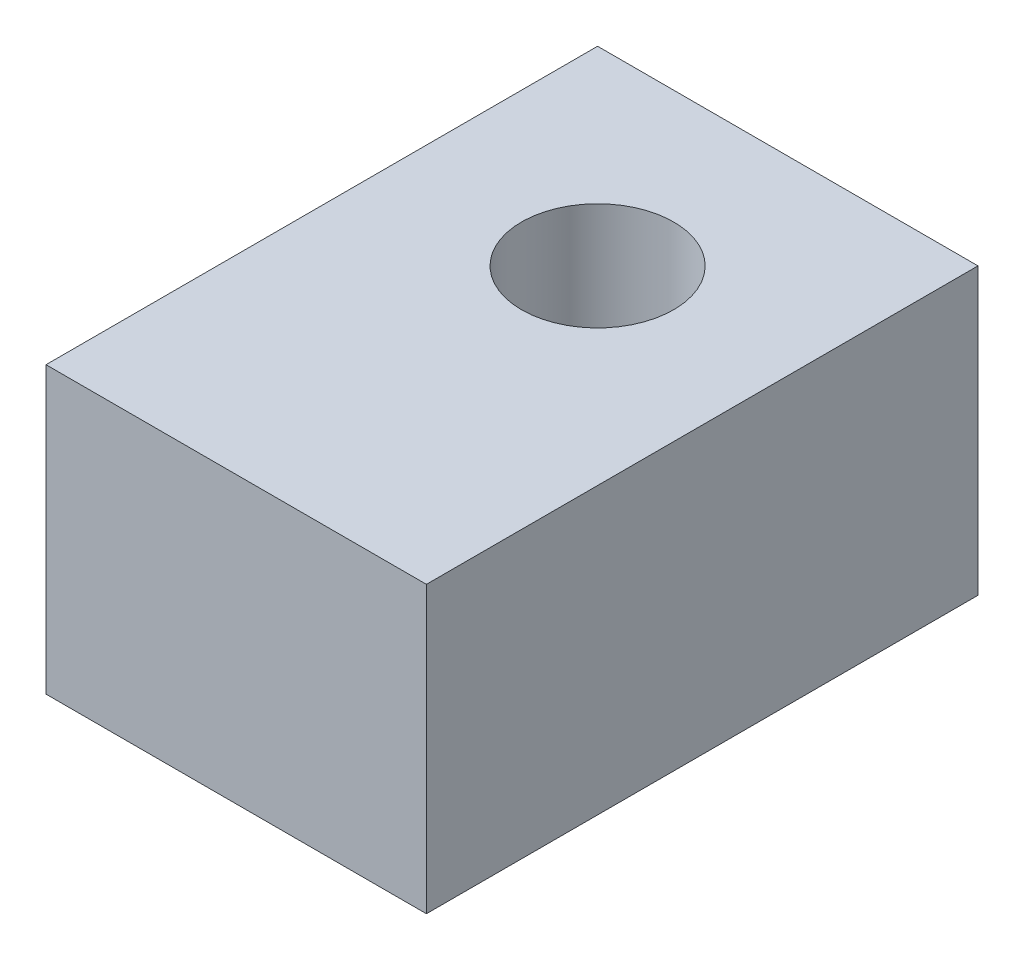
ISO-10303-21;
HEADER;
FILE_DESCRIPTION(('STEP AP214'),'2;1');
FILE_NAME('part.step','',(''),(''),'','','');
FILE_SCHEMA(('AUTOMOTIVE_DESIGN { 1 0 10303 214 1 1 1 1 }'));
ENDSEC;
DATA;
#1=APPLICATION_CONTEXT('core data for automotive mechanical design processes');
#2=APPLICATION_PROTOCOL_DEFINITION('international standard','automotive_design',2000,#1);
#3=PRODUCT_CONTEXT('',#1,'mechanical');
#4=PRODUCT('Part','Part','',(#3));
#5=PRODUCT_RELATED_PRODUCT_CATEGORY('part','',(#4));
#6=PRODUCT_DEFINITION_FORMATION('','',#4);
#7=PRODUCT_DEFINITION_CONTEXT('part definition',#1,'design');
#8=PRODUCT_DEFINITION('design','',#6,#7);
#9=PRODUCT_DEFINITION_SHAPE('','',#8);
#10=(LENGTH_UNIT() NAMED_UNIT(*) SI_UNIT(.MILLI.,.METRE.));
#11=(NAMED_UNIT(*) PLANE_ANGLE_UNIT() SI_UNIT($,.RADIAN.));
#12=(NAMED_UNIT(*) SI_UNIT($,.STERADIAN.) SOLID_ANGLE_UNIT());
#13=UNCERTAINTY_MEASURE_WITH_UNIT(LENGTH_MEASURE(1.E-05),#10,'distance_accuracy_value','');
#14=(GEOMETRIC_REPRESENTATION_CONTEXT(3) GLOBAL_UNCERTAINTY_ASSIGNED_CONTEXT((#13)) GLOBAL_UNIT_ASSIGNED_CONTEXT((#10,
#11,#12)) REPRESENTATION_CONTEXT('',''));
#15=CARTESIAN_POINT('',(0.,0.,0.));
#16=DIRECTION('',(0.,0.,1.));
#17=DIRECTION('',(1.,0.,0.));
#18=AXIS2_PLACEMENT_3D('',#15,#16,#17);
#19=CARTESIAN_POINT('',(-20.,15.,58.));
#20=DIRECTION('',(1.,0.,0.));
#21=DIRECTION('',(0.,0.,-1.));
#22=AXIS2_PLACEMENT_3D('',#19,#20,#21);
#23=PLANE('',#22);
#24=DIRECTION('',(0.,-1.,0.));
#25=VECTOR('',#24,1.);
#26=CARTESIAN_POINT('',(-20.,15.,0.));
#27=LINE('',#26,#25);
#28=CARTESIAN_POINT('',(-20.,15.,0.));
#29=VERTEX_POINT('',#28);
#30=CARTESIAN_POINT('',(-20.,-15.,0.));
#31=VERTEX_POINT('',#30);
#32=EDGE_CURVE('E93',#29,#31,#27,.T.);
#33=ORIENTED_EDGE('',*,*,#32,.T.);
#34=DIRECTION('',(0.,0.,-1.));
#35=VECTOR('',#34,1.);
#36=CARTESIAN_POINT('',(-20.,-15.,58.));
#37=LINE('',#36,#35);
#38=CARTESIAN_POINT('',(-20.,-15.,58.));
#39=VERTEX_POINT('',#38);
#40=EDGE_CURVE('E11',#39,#31,#37,.T.);
#41=ORIENTED_EDGE('',*,*,#40,.F.);
#42=DIRECTION('',(0.,-1.,0.));
#43=VECTOR('',#42,1.);
#44=CARTESIAN_POINT('',(-20.,15.,58.));
#45=LINE('',#44,#43);
#46=CARTESIAN_POINT('',(-20.,15.,58.));
#47=VERTEX_POINT('',#46);
#48=EDGE_CURVE('E81',#47,#39,#45,.T.);
#49=ORIENTED_EDGE('',*,*,#48,.F.);
#50=DIRECTION('',(0.,0.,-1.));
#51=VECTOR('',#50,1.);
#52=CARTESIAN_POINT('',(-20.,15.,58.));
#53=LINE('',#52,#51);
#54=EDGE_CURVE('E89',#47,#29,#53,.T.);
#55=ORIENTED_EDGE('',*,*,#54,.T.);
#56=EDGE_LOOP('',(#33,#41,#49,#55));
#57=FACE_BOUND('',#56,.T.);
#58=ADVANCED_FACE('F30',(#57),#23,.F.);
#59=CARTESIAN_POINT('',(-20.,-15.,58.));
#60=DIRECTION('',(0.,1.,0.));
#61=DIRECTION('',(0.,0.,1.));
#62=AXIS2_PLACEMENT_3D('',#59,#60,#61);
#63=PLANE('',#62);
#64=CARTESIAN_POINT('',(0.,-15.,20.));
#65=DIRECTION('',(0.,1.,0.));
#66=DIRECTION('',(0.,0.,1.));
#67=AXIS2_PLACEMENT_3D('',#64,#65,#66);
#68=CIRCLE('',#67,7.99999999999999);
#69=CARTESIAN_POINT('',(0.,-15.,28.));
#70=VERTEX_POINT('',#69);
#71=EDGE_CURVE('E109',#70,#70,#68,.T.);
#72=ORIENTED_EDGE('',*,*,#71,.T.);
#73=EDGE_LOOP('',(#72));
#74=FACE_BOUND('',#73,.T.);
#75=DIRECTION('',(1.,0.,0.));
#76=VECTOR('',#75,1.);
#77=CARTESIAN_POINT('',(-20.,-15.,0.));
#78=LINE('',#77,#76);
#79=CARTESIAN_POINT('',(20.,-15.,0.));
#80=VERTEX_POINT('',#79);
#81=EDGE_CURVE('E85',#31,#80,#78,.T.);
#82=ORIENTED_EDGE('',*,*,#81,.T.);
#83=DIRECTION('',(0.,0.,-1.));
#84=VECTOR('',#83,1.);
#85=CARTESIAN_POINT('',(20.,-15.,58.));
#86=LINE('',#85,#84);
#87=CARTESIAN_POINT('',(20.,-15.,58.));
#88=VERTEX_POINT('',#87);
#89=EDGE_CURVE('E38',#88,#80,#86,.T.);
#90=ORIENTED_EDGE('',*,*,#89,.F.);
#91=DIRECTION('',(1.,0.,0.));
#92=VECTOR('',#91,1.);
#93=CARTESIAN_POINT('',(-20.,-15.,58.));
#94=LINE('',#93,#92);
#95=EDGE_CURVE('E76',#39,#88,#94,.T.);
#96=ORIENTED_EDGE('',*,*,#95,.F.);
#97=ORIENTED_EDGE('',*,*,#40,.T.);
#98=EDGE_LOOP('',(#82,#90,#96,#97));
#99=FACE_BOUND('',#98,.T.);
#100=ADVANCED_FACE('F84',(#74,#99),#63,.F.);
#101=CARTESIAN_POINT('',(20.,15.,58.));
#102=DIRECTION('',(-1.,0.,0.));
#103=DIRECTION('',(0.,-1.,0.));
#104=AXIS2_PLACEMENT_3D('',#101,#102,#103);
#105=PLANE('',#104);
#106=DIRECTION('',(0.,1.,0.));
#107=VECTOR('',#106,1.);
#108=CARTESIAN_POINT('',(20.,15.,0.));
#109=LINE('',#108,#107);
#110=CARTESIAN_POINT('',(20.,15.,0.));
#111=VERTEX_POINT('',#110);
#112=EDGE_CURVE('E63',#80,#111,#109,.T.);
#113=ORIENTED_EDGE('',*,*,#112,.T.);
#114=DIRECTION('',(0.,0.,-1.));
#115=VECTOR('',#114,1.);
#116=CARTESIAN_POINT('',(20.,15.,58.));
#117=LINE('',#116,#115);
#118=CARTESIAN_POINT('',(20.,15.,58.));
#119=VERTEX_POINT('',#118);
#120=EDGE_CURVE('E86',#119,#111,#117,.T.);
#121=ORIENTED_EDGE('',*,*,#120,.F.);
#122=DIRECTION('',(0.,1.,0.));
#123=VECTOR('',#122,1.);
#124=CARTESIAN_POINT('',(20.,15.,58.));
#125=LINE('',#124,#123);
#126=EDGE_CURVE('E79',#88,#119,#125,.T.);
#127=ORIENTED_EDGE('',*,*,#126,.F.);
#128=ORIENTED_EDGE('',*,*,#89,.T.);
#129=EDGE_LOOP('',(#113,#121,#127,#128));
#130=FACE_BOUND('',#129,.T.);
#131=ADVANCED_FACE('F87',(#130),#105,.F.);
#132=CARTESIAN_POINT('',(-20.,15.,58.));
#133=DIRECTION('',(0.,-1.,0.));
#134=DIRECTION('',(0.,0.,-1.));
#135=AXIS2_PLACEMENT_3D('',#132,#133,#134);
#136=PLANE('',#135);
#137=CARTESIAN_POINT('',(0.,15.,20.));
#138=DIRECTION('',(0.,1.,0.));
#139=DIRECTION('',(0.,0.,1.));
#140=AXIS2_PLACEMENT_3D('',#137,#138,#139);
#141=CIRCLE('',#140,8.);
#142=CARTESIAN_POINT('',(0.,15.,28.));
#143=VERTEX_POINT('',#142);
#144=EDGE_CURVE('E96',#143,#143,#141,.T.);
#145=ORIENTED_EDGE('',*,*,#144,.F.);
#146=EDGE_LOOP('',(#145));
#147=FACE_BOUND('',#146,.T.);
#148=DIRECTION('',(-1.,0.,0.));
#149=VECTOR('',#148,1.);
#150=CARTESIAN_POINT('',(-20.,15.,0.));
#151=LINE('',#150,#149);
#152=EDGE_CURVE('E69',#111,#29,#151,.T.);
#153=ORIENTED_EDGE('',*,*,#152,.T.);
#154=ORIENTED_EDGE('',*,*,#54,.F.);
#155=DIRECTION('',(-1.,0.,0.));
#156=VECTOR('',#155,1.);
#157=CARTESIAN_POINT('',(-20.,15.,58.));
#158=LINE('',#157,#156);
#159=EDGE_CURVE('E46',#119,#47,#158,.T.);
#160=ORIENTED_EDGE('',*,*,#159,.F.);
#161=ORIENTED_EDGE('',*,*,#120,.T.);
#162=EDGE_LOOP('',(#153,#154,#160,#161));
#163=FACE_BOUND('',#162,.T.);
#164=ADVANCED_FACE('F101',(#147,#163),#136,.F.);
#165=CARTESIAN_POINT('',(-20.,-15.,58.));
#166=DIRECTION('',(0.,0.,1.));
#167=DIRECTION('',(1.,0.,0.));
#168=AXIS2_PLACEMENT_3D('',#165,#166,#167);
#169=PLANE('',#168);
#170=ORIENTED_EDGE('',*,*,#48,.T.);
#171=ORIENTED_EDGE('',*,*,#95,.T.);
#172=ORIENTED_EDGE('',*,*,#126,.T.);
#173=ORIENTED_EDGE('',*,*,#159,.T.);
#174=EDGE_LOOP('',(#170,#171,#172,#173));
#175=FACE_BOUND('',#174,.T.);
#176=ADVANCED_FACE('F77',(#175),#169,.T.);
#177=CARTESIAN_POINT('',(-20.,-15.,0.));
#178=DIRECTION('',(0.,0.,1.));
#179=DIRECTION('',(1.,0.,0.));
#180=AXIS2_PLACEMENT_3D('',#177,#178,#179);
#181=PLANE('',#180);
#182=ORIENTED_EDGE('',*,*,#32,.F.);
#183=ORIENTED_EDGE('',*,*,#152,.F.);
#184=ORIENTED_EDGE('',*,*,#112,.F.);
#185=ORIENTED_EDGE('',*,*,#81,.F.);
#186=EDGE_LOOP('',(#182,#183,#184,#185));
#187=FACE_BOUND('',#186,.T.);
#188=ADVANCED_FACE('F104',(#187),#181,.F.);
#189=CARTESIAN_POINT('',(0.,15.,20.));
#190=DIRECTION('',(0.,1.,0.));
#191=DIRECTION('',(0.,0.,1.));
#192=AXIS2_PLACEMENT_3D('',#189,#190,#191);
#193=CYLINDRICAL_SURFACE('',#192,7.99999999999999);
#194=ORIENTED_EDGE('',*,*,#71,.F.);
#195=EDGE_LOOP('',(#194));
#196=FACE_BOUND('',#195,.T.);
#197=ORIENTED_EDGE('',*,*,#144,.T.);
#198=EDGE_LOOP('',(#197));
#199=FACE_BOUND('',#198,.T.);
#200=ADVANCED_FACE('F114',(#196,#199),#193,.F.);
#201=CLOSED_SHELL('',(#58,#100,#131,#164,#176,#188,#200));
#202=MANIFOLD_SOLID_BREP('B2',#201);
#203=ADVANCED_BREP_SHAPE_REPRESENTATION('',(#18,#202),#14);
#204=SHAPE_DEFINITION_REPRESENTATION(#9,#203);
ENDSEC;
END-ISO-10303-21;
